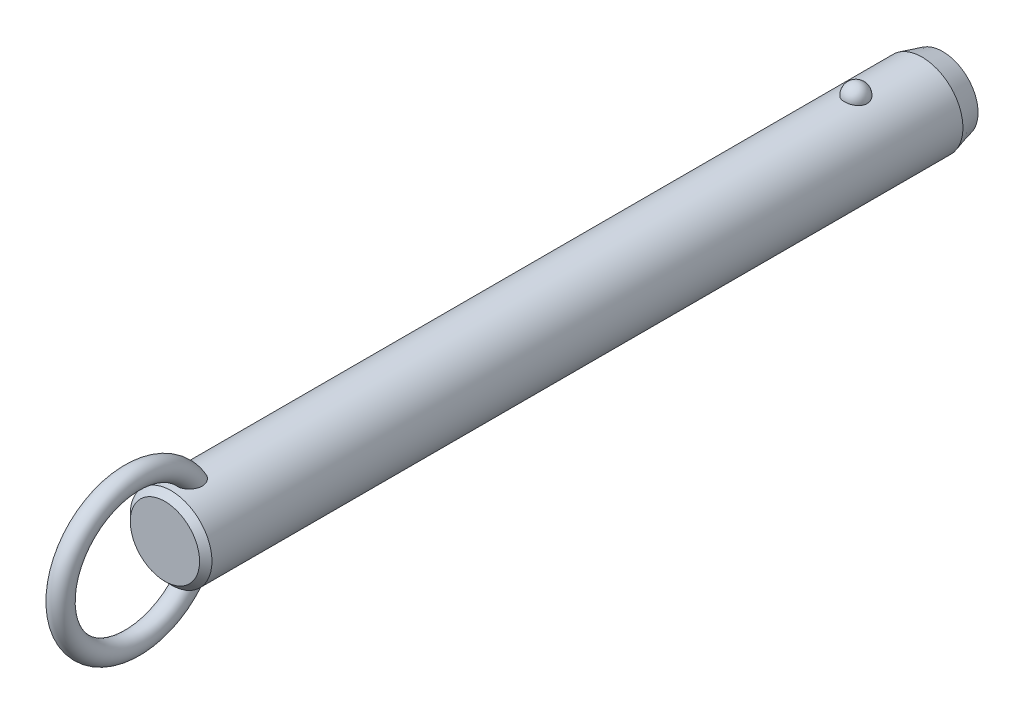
ISO-10303-21;
HEADER;
FILE_DESCRIPTION(('STEP AP214'),'2;1');
FILE_NAME('part.step','',(''),(''),'','','');
FILE_SCHEMA(('AUTOMOTIVE_DESIGN { 1 0 10303 214 1 1 1 1 }'));
ENDSEC;
DATA;
#1=APPLICATION_CONTEXT('core data for automotive mechanical design processes');
#2=APPLICATION_PROTOCOL_DEFINITION('international standard','automotive_design',2000,#1);
#3=PRODUCT_CONTEXT('',#1,'mechanical');
#4=PRODUCT('Part','Part','',(#3));
#5=PRODUCT_RELATED_PRODUCT_CATEGORY('part','',(#4));
#6=PRODUCT_DEFINITION_FORMATION('','',#4);
#7=PRODUCT_DEFINITION_CONTEXT('part definition',#1,'design');
#8=PRODUCT_DEFINITION('design','',#6,#7);
#9=PRODUCT_DEFINITION_SHAPE('','',#8);
#10=(LENGTH_UNIT() NAMED_UNIT(*) SI_UNIT(.MILLI.,.METRE.));
#11=(NAMED_UNIT(*) PLANE_ANGLE_UNIT() SI_UNIT($,.RADIAN.));
#12=(NAMED_UNIT(*) SI_UNIT($,.STERADIAN.) SOLID_ANGLE_UNIT());
#13=UNCERTAINTY_MEASURE_WITH_UNIT(LENGTH_MEASURE(1.E-05),#10,'distance_accuracy_value','');
#14=(GEOMETRIC_REPRESENTATION_CONTEXT(3) GLOBAL_UNCERTAINTY_ASSIGNED_CONTEXT((#13)) GLOBAL_UNIT_ASSIGNED_CONTEXT((#10,
#11,#12)) REPRESENTATION_CONTEXT('',''));
#15=CARTESIAN_POINT('',(0.,0.,0.));
#16=DIRECTION('',(0.,0.,1.));
#17=DIRECTION('',(1.,0.,0.));
#18=AXIS2_PLACEMENT_3D('',#15,#16,#17);
#19=CARTESIAN_POINT('',(0.,0.,121.9));
#20=DIRECTION('',(0.,0.,-1.));
#21=DIRECTION('',(-1.,0.,0.));
#22=AXIS2_PLACEMENT_3D('',#19,#20,#21);
#23=CYLINDRICAL_SURFACE('',#22,7.9);
#24=CARTESIAN_POINT('',(2.1785689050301,7.59367088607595,-2.19999999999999));
#25=CARTESIAN_POINT('',(2.17856679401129,7.59367269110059,-2.07701843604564));
#26=CARTESIAN_POINT('',(2.16853481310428,7.59657145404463,-1.95401006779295));
#27=CARTESIAN_POINT('',(2.12864689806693,7.607843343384,-1.71147811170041));
#28=CARTESIAN_POINT('',(2.09878338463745,7.61621856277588,-1.59195587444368));
#29=CARTESIAN_POINT('',(2.0199931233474,7.63749180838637,-1.3598563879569));
#30=CARTESIAN_POINT('',(1.97107475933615,7.6503878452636,-1.24727610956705));
#31=CARTESIAN_POINT('',(1.85539377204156,7.67926115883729,-1.03213234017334));
#32=CARTESIAN_POINT('',(1.78863158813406,7.69523835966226,-0.929568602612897));
#33=CARTESIAN_POINT('',(1.63856494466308,7.7285848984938,-0.736786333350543));
#34=CARTESIAN_POINT('',(1.55518140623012,7.7459606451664,-0.646630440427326));
#35=CARTESIAN_POINT('',(1.37422937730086,7.78009978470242,-0.481747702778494));
#36=CARTESIAN_POINT('',(1.27666086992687,7.79686317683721,-0.407020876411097));
#37=CARTESIAN_POINT('',(1.07024728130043,7.82786153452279,-0.275278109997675));
#38=CARTESIAN_POINT('',(0.961434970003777,7.84210353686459,-0.218212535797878));
#39=CARTESIAN_POINT('',(0.735351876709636,7.86652194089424,-0.123146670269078));
#40=CARTESIAN_POINT('',(0.618082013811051,7.87669878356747,-0.085144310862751));
#41=CARTESIAN_POINT('',(0.380637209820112,7.89170521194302,-0.0298158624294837));
#42=CARTESIAN_POINT('',(0.260550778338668,7.89662650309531,-0.0121347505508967));
#43=CARTESIAN_POINT('',(0.0190117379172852,7.90090003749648,0.00324379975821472));
#44=CARTESIAN_POINT('',(-0.102440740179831,7.90025280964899,0.00094313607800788));
#45=CARTESIAN_POINT('',(-0.341452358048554,7.89351056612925,-0.0233955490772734));
#46=CARTESIAN_POINT('',(-0.459042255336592,7.88749257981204,-0.0451545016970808));
#47=CARTESIAN_POINT('',(-0.688796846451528,7.87075812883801,-0.107408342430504));
#48=CARTESIAN_POINT('',(-0.800961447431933,7.86004158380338,-0.147903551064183));
#49=CARTESIAN_POINT('',(-1.01743634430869,7.83497131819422,-0.246799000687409));
#50=CARTESIAN_POINT('',(-1.12169791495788,7.82059709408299,-0.305300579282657));
#51=CARTESIAN_POINT('',(-1.31891765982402,7.78976470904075,-0.438549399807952));
#52=CARTESIAN_POINT('',(-1.41187469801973,7.77330633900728,-0.513298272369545));
#53=CARTESIAN_POINT('',(-1.58577142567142,7.73972434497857,-0.678622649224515));
#54=CARTESIAN_POINT('',(-1.66645140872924,7.72259402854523,-0.769470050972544));
#55=CARTESIAN_POINT('',(-1.81161503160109,7.68983776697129,-0.963538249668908));
#56=CARTESIAN_POINT('',(-1.87609753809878,7.6742119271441,-1.06675991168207));
#57=CARTESIAN_POINT('',(-1.98790138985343,7.6460202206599,-1.28401170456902));
#58=CARTESIAN_POINT('',(-2.03501994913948,7.63349104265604,-1.39815107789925));
#59=CARTESIAN_POINT('',(-2.10986724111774,7.6131449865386,-1.63301784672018));
#60=CARTESIAN_POINT('',(-2.1375965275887,7.60532797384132,-1.75374505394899));
#61=CARTESIAN_POINT('',(-2.17289256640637,7.5953195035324,-1.99782562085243));
#62=CARTESIAN_POINT('',(-2.18054294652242,7.59310471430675,-2.12116592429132));
#63=CARTESIAN_POINT('',(-2.17572919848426,7.59448538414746,-2.36741799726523));
#64=CARTESIAN_POINT('',(-2.1632656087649,7.59808068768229,-2.49032977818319));
#65=CARTESIAN_POINT('',(-2.11865035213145,7.61064035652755,-2.73161015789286));
#66=CARTESIAN_POINT('',(-2.08659579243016,7.61957823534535,-2.84999812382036));
#67=CARTESIAN_POINT('',(-2.00367799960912,7.64179982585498,-3.07955956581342));
#68=CARTESIAN_POINT('',(-1.9528140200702,7.65508371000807,-3.19073275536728));
#69=CARTESIAN_POINT('',(-1.83321113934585,7.68460381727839,-3.40337899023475));
#70=CARTESIAN_POINT('',(-1.76437735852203,7.70085556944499,-3.50479651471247));
#71=CARTESIAN_POINT('',(-1.61069526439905,7.73445734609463,-3.69446912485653));
#72=CARTESIAN_POINT('',(-1.52584634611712,7.75180741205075,-3.78272371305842));
#73=CARTESIAN_POINT('',(-1.34198059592,7.78574608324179,-3.94393987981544));
#74=CARTESIAN_POINT('',(-1.24291308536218,7.80233167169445,-4.01684434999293));
#75=CARTESIAN_POINT('',(-1.03352039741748,7.83281625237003,-4.14489386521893));
#76=CARTESIAN_POINT('',(-0.92319600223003,7.84671543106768,-4.20004014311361));
#77=CARTESIAN_POINT('',(-0.695822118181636,7.87011575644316,-4.29042017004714));
#78=CARTESIAN_POINT('',(-0.578872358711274,7.87966903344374,-4.32589112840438));
#79=CARTESIAN_POINT('',(-0.340410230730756,7.8935652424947,-4.37692226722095));
#80=CARTESIAN_POINT('',(-0.218898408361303,7.89790879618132,-4.39248482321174));
#81=CARTESIAN_POINT('',(0.0228107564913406,7.90087453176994,-4.40314405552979));
#82=CARTESIAN_POINT('',(0.142990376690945,7.89960185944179,-4.39861683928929));
#83=CARTESIAN_POINT('',(0.380829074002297,7.89171262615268,-4.37008293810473));
#84=CARTESIAN_POINT('',(0.498488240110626,7.8850962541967,-4.34607694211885));
#85=CARTESIAN_POINT('',(0.727535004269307,7.86726442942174,-4.27939317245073));
#86=CARTESIAN_POINT('',(0.838944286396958,7.85606616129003,-4.236785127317));
#87=CARTESIAN_POINT('',(1.05295421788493,7.83025654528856,-4.13408348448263));
#88=CARTESIAN_POINT('',(1.15555431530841,7.81564498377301,-4.07398879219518));
#89=CARTESIAN_POINT('',(1.35076763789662,7.7843022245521,-3.93687432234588));
#90=CARTESIAN_POINT('',(1.4432046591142,7.76754209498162,-3.85961036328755));
#91=CARTESIAN_POINT('',(1.6139111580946,7.73387857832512,-3.69076949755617));
#92=CARTESIAN_POINT('',(1.6921781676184,7.71697516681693,-3.59919010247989));
#93=CARTESIAN_POINT('',(1.83380875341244,7.6845643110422,-3.40247278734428));
#94=CARTESIAN_POINT('',(1.89689280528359,7.66908588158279,-3.29712873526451));
#95=CARTESIAN_POINT('',(2.0047823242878,7.64159441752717,-3.07707931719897));
#96=CARTESIAN_POINT('',(2.0495945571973,7.62958010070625,-2.96237743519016));
#97=CARTESIAN_POINT('',(2.11580183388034,7.61146617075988,-2.74040519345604));
#98=CARTESIAN_POINT('',(2.13929812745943,7.60484503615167,-2.63379846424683));
#99=CARTESIAN_POINT('',(2.17068242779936,7.59594664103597,-2.41813481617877));
#100=CARTESIAN_POINT('',(2.17857077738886,7.59366928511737,-2.30907795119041));
#101=CARTESIAN_POINT('',(2.1785689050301,7.59367088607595,-2.19999999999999));
#102=B_SPLINE_CURVE_WITH_KNOTS('',3,(#24,#25,#26,#27,#28,#29,#30,#31,#32,#33,#34,#35,#36,#37,
#38,#39,#40,#41,#42,#43,#44,#45,#46,#47,#48,#49,#50,#51,#52,#53,#54,#55,#56,#57,#58,#59,#60,#61,
#62,#63,#64,#65,#66,#67,#68,#69,#70,#71,#72,#73,#74,#75,#76,#77,#78,#79,#80,#81,#82,#83,#84,#85,
#86,#87,#88,#89,#90,#91,#92,#93,#94,#95,#96,#97,#98,#99,#100,#101),.UNSPECIFIED.,.T.,.F.,(4,2,2,
2,2,2,2,2,2,2,2,2,2,2,2,2,2,2,2,2,2,2,2,2,2,2,2,2,2,2,2,2,2,2,2,2,2,2,4),(0.,0.368552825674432,
0.737246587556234,1.10577831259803,1.4743009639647,1.8446206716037,2.21494081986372,
2.5842105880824,2.95344028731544,3.31611630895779,3.67875788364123,4.03628044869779,
4.39380913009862,4.75338791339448,5.11300280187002,5.47939989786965,5.8458226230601,
6.21639834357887,6.58696347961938,6.95598276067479,7.32499216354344,7.69218715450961,
8.0593967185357,8.42858578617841,8.79778880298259,9.16834203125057,9.5388695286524,
9.90482699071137,10.2707407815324,10.6298333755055,10.9889132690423,11.3466585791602,
11.7044262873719,12.0676511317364,12.4309391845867,12.8004764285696,13.1698767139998,
13.4967701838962,13.8236564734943),.UNSPECIFIED.);
#103=CARTESIAN_POINT('',(2.1785689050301,7.59367088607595,-2.19999999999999));
#104=VERTEX_POINT('',#103);
#105=EDGE_CURVE('E41',#104,#104,#102,.T.);
#106=ORIENTED_EDGE('',*,*,#105,.T.);
#107=EDGE_LOOP('',(#106));
#108=FACE_BOUND('',#107,.T.);
#109=CARTESIAN_POINT('',(0.,0.,130.22));
#110=DIRECTION('',(0.,0.,1.));
#111=DIRECTION('',(1.,0.,0.));
#112=AXIS2_PLACEMENT_3D('',#109,#110,#111);
#113=CIRCLE('',#112,7.9);
#114=CARTESIAN_POINT('',(7.9,0.,130.22));
#115=VERTEX_POINT('',#114);
#116=EDGE_CURVE('E10',#115,#115,#113,.F.);
#117=ORIENTED_EDGE('',*,*,#116,.T.);
#118=EDGE_LOOP('',(#117));
#119=FACE_BOUND('',#118,.T.);
#120=CARTESIAN_POINT('',(-0.630969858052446,-7.87476203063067,124.112432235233));
#121=CARTESIAN_POINT('',(-0.734180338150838,-7.8664899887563,124.147285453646));
#122=CARTESIAN_POINT('',(-0.834476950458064,-7.85639291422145,124.190816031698));
#123=CARTESIAN_POINT('',(-1.02620356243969,-7.83366343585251,124.294094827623));
#124=CARTESIAN_POINT('',(-1.1176141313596,-7.82102565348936,124.353877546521));
#125=CARTESIAN_POINT('',(-1.28877277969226,-7.79464922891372,124.487839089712));
#126=CARTESIAN_POINT('',(-1.36854014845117,-7.78091246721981,124.561993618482));
#127=CARTESIAN_POINT('',(-1.5146152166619,-7.75380398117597,124.722494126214));
#128=CARTESIAN_POINT('',(-1.58092966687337,-7.74043207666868,124.808833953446));
#129=CARTESIAN_POINT('',(-1.70019064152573,-7.71512522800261,124.992978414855));
#130=CARTESIAN_POINT('',(-1.75284037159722,-7.70322473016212,125.090979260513));
#131=CARTESIAN_POINT('',(-1.84263464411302,-7.68224112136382,125.294102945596));
#132=CARTESIAN_POINT('',(-1.87977299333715,-7.6731591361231,125.399228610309));
#133=CARTESIAN_POINT('',(-1.94152728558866,-7.65777930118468,125.623284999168));
#134=CARTESIAN_POINT('',(-1.96475471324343,-7.65179654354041,125.742616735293));
#135=CARTESIAN_POINT('',(-1.99449499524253,-7.64409642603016,125.98342986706));
#136=CARTESIAN_POINT('',(-2.0010005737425,-7.64238092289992,126.104912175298));
#137=CARTESIAN_POINT('',(-1.99856014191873,-7.64302120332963,126.368340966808));
#138=CARTESIAN_POINT('',(-1.98680021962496,-7.64611845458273,126.51025654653));
#139=CARTESIAN_POINT('',(-1.94457772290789,-7.65696186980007,126.791118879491));
#140=CARTESIAN_POINT('',(-1.91409393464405,-7.66471330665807,126.930062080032));
#141=CARTESIAN_POINT('',(-1.82768670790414,-7.68582947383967,127.231939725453));
#142=CARTESIAN_POINT('',(-1.76772963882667,-7.70003779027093,127.393686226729));
#143=CARTESIAN_POINT('',(-1.65998501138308,-7.72371550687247,127.627695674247));
#144=CARTESIAN_POINT('',(-1.62107967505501,-7.73200670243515,127.704297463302));
#145=CARTESIAN_POINT('',(-1.53727726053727,-7.74910377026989,127.854079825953));
#146=CARTESIAN_POINT('',(-1.49238215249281,-7.75790947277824,127.927261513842));
#147=CARTESIAN_POINT('',(-1.37397050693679,-7.77993338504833,128.10288382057));
#148=CARTESIAN_POINT('',(-1.29690364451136,-7.79328473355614,128.202955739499));
#149=CARTESIAN_POINT('',(-1.1288548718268,-7.81939266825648,128.390714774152));
#150=CARTESIAN_POINT('',(-1.0378992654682,-7.83215032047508,128.478424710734));
#151=CARTESIAN_POINT('',(-0.869532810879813,-7.85231710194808,128.613414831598));
#152=CARTESIAN_POINT('',(-0.795716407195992,-7.86021093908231,128.665076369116));
#153=CARTESIAN_POINT('',(-0.640813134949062,-7.87434920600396,128.756381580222));
#154=CARTESIAN_POINT('',(-0.559737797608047,-7.88059619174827,128.79604389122));
#155=CARTESIAN_POINT('',(-0.406456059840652,-7.88984116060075,128.854300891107));
#156=CARTESIAN_POINT('',(-0.335227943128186,-7.89321892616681,128.875384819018));
#157=CARTESIAN_POINT('',(-0.190193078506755,-7.89804235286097,128.90541418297));
#158=CARTESIAN_POINT('',(-0.116388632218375,-7.89948969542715,128.914370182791));
#159=CARTESIAN_POINT('',(0.0318414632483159,-7.90028409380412,128.919291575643));
#160=CARTESIAN_POINT('',(0.106268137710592,-7.89962640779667,128.915227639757));
#161=CARTESIAN_POINT('',(0.253290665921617,-7.8962818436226,128.894461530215));
#162=CARTESIAN_POINT('',(0.325885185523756,-7.8935935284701,128.877750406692));
#163=CARTESIAN_POINT('',(0.481441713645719,-7.88577340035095,128.828738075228));
#164=CARTESIAN_POINT('',(0.563611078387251,-7.88026321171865,128.794005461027));
#165=CARTESIAN_POINT('',(0.721129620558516,-7.86741729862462,128.711796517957));
#166=CARTESIAN_POINT('',(0.79646633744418,-7.86007832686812,128.664297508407));
#167=CARTESIAN_POINT('',(0.971456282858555,-7.84073285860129,128.536513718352));
#168=CARTESIAN_POINT('',(1.06719686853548,-7.82809461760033,128.451004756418));
#169=CARTESIAN_POINT('',(1.24418921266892,-7.80192439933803,128.266232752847));
#170=CARTESIAN_POINT('',(1.32540832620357,-7.78839049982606,128.166939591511));
#171=CARTESIAN_POINT('',(1.45199971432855,-7.76559693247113,127.989576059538));
#172=CARTESIAN_POINT('',(1.50085649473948,-7.75626094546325,127.913954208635));
#173=CARTESIAN_POINT('',(1.59197749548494,-7.73807279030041,127.758742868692));
#174=CARTESIAN_POINT('',(1.63423919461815,-7.72922080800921,127.679151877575));
#175=CARTESIAN_POINT('',(1.71222612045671,-7.71231959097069,127.516664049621));
#176=CARTESIAN_POINT('',(1.74794516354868,-7.70427111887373,127.433764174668));
#177=CARTESIAN_POINT('',(1.81270113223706,-7.68929240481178,127.265296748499));
#178=CARTESIAN_POINT('',(1.84173789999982,-7.68236218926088,127.179729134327));
#179=CARTESIAN_POINT('',(1.89322698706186,-7.6698375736,127.00528702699));
#180=CARTESIAN_POINT('',(1.91558744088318,-7.66426199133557,126.916383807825));
#181=CARTESIAN_POINT('',(1.95281367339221,-7.65485915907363,126.736969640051));
#182=CARTESIAN_POINT('',(1.96767946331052,-7.65103190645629,126.646458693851));
#183=CARTESIAN_POINT('',(2.0002145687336,-7.64262981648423,126.373732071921));
#184=CARTESIAN_POINT('',(2.00600691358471,-7.6410871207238,126.189709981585));
#185=CARTESIAN_POINT('',(1.98445334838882,-7.64669564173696,125.876501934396));
#186=CARTESIAN_POINT('',(1.96607186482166,-7.65149688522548,125.746618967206));
#187=CARTESIAN_POINT('',(1.90884967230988,-7.66597624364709,125.491632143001));
#188=CARTESIAN_POINT('',(1.87002101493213,-7.67565148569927,125.366525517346));
#189=CARTESIAN_POINT('',(1.77063986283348,-7.69918471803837,125.12454013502));
#190=CARTESIAN_POINT('',(1.70993724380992,-7.71307150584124,125.007725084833));
#191=CARTESIAN_POINT('',(1.56733070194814,-7.74330306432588,124.788144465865));
#192=CARTESIAN_POINT('',(1.48543692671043,-7.75964665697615,124.685372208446));
#193=CARTESIAN_POINT('',(1.31346177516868,-7.79047523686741,124.509380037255));
#194=CARTESIAN_POINT('',(1.22547278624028,-7.80495298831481,124.434106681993));
#195=CARTESIAN_POINT('',(1.03724352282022,-7.83218597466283,124.300486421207));
#196=CARTESIAN_POINT('',(0.937008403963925,-7.84494192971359,124.242132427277));
#197=CARTESIAN_POINT('',(0.733599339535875,-7.86649045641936,124.147027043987));
#198=CARTESIAN_POINT('',(0.630941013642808,-7.87547134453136,124.109210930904));
#199=CARTESIAN_POINT('',(0.420465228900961,-7.88950708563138,124.051116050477));
#200=CARTESIAN_POINT('',(0.312645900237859,-7.89456050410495,124.03084369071));
#201=CARTESIAN_POINT('',(0.0960869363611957,-7.9001518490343,124.008455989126));
#202=CARTESIAN_POINT('',(-0.0126341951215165,-7.90073226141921,124.006169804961));
#203=CARTESIAN_POINT('',(-0.228766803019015,-7.89742350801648,124.019367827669));
#204=CARTESIAN_POINT('',(-0.336180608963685,-7.89354403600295,124.034813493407));
#205=CARTESIAN_POINT('',(-0.473410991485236,-7.88586871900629,124.066217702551));
#206=CARTESIAN_POINT('',(-0.505257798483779,-7.88388984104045,124.074354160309));
#207=CARTESIAN_POINT('',(-0.568481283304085,-7.87958326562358,124.092208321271));
#208=CARTESIAN_POINT('',(-0.599857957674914,-7.87725556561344,124.101926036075));
#209=CARTESIAN_POINT('',(-0.630969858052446,-7.87476203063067,124.112432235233));
#210=B_SPLINE_CURVE_WITH_KNOTS('',3,(#120,#121,#122,#123,#124,#125,#126,#127,#128,#129,#130,
#131,#132,#133,#134,#135,#136,#137,#138,#139,#140,#141,#142,#143,#144,#145,#146,#147,#148,#149,
#150,#151,#152,#153,#154,#155,#156,#157,#158,#159,#160,#161,#162,#163,#164,#165,#166,#167,#168,
#169,#170,#171,#172,#173,#174,#175,#176,#177,#178,#179,#180,#181,#182,#183,#184,#185,#186,#187,
#188,#189,#190,#191,#192,#193,#194,#195,#196,#197,#198,#199,#200,#201,#202,#203,#204,#205,#206,
#207,#208,#209),.UNSPECIFIED.,.T.,.F.,(4,2,2,2,2,2,2,2,2,2,2,2,2,2,2,2,2,2,2,2,2,2,2,2,2,2,2,2,
2,2,2,2,2,2,2,2,2,2,2,2,2,2,2,2,4),(0.,0.327622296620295,0.655945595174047,0.983718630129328,
1.3113267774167,1.64554655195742,1.97989964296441,2.34365728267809,2.70757317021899,
3.13333684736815,3.55958380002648,4.07655306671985,4.33527897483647,4.593919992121,
4.9738243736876,5.35301797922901,5.62348245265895,5.89352465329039,6.11565959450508,
6.33760092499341,6.56004255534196,6.78264174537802,7.04930844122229,7.31645206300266,
7.70130871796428,8.08701995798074,8.35824509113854,8.6295736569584,8.90115735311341,
9.1727474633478,9.447918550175,9.7230892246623,10.2715298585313,10.6638393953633,
11.0559179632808,11.4507403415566,11.8453740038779,12.1936425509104,12.5417649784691,
12.8695063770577,13.1973674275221,13.5221104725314,13.8461490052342,13.9449071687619,
14.0436660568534),.UNSPECIFIED.);
#211=CARTESIAN_POINT('',(-0.630969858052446,-7.87476203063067,124.112432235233));
#212=VERTEX_POINT('',#211);
#213=EDGE_CURVE('E59',#212,#212,#210,.T.);
#214=ORIENTED_EDGE('',*,*,#213,.T.);
#215=EDGE_LOOP('',(#214));
#216=FACE_BOUND('',#215,.T.);
#217=CARTESIAN_POINT('',(-0.630969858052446,7.87476203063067,124.112432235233));
#218=CARTESIAN_POINT('',(-0.528918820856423,7.88293636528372,124.077979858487));
#219=CARTESIAN_POINT('',(-0.42374551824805,7.8893481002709,124.051915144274));
#220=CARTESIAN_POINT('',(-0.210236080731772,7.8979273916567,124.017282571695));
#221=CARTESIAN_POINT('',(-0.10189380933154,7.90008607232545,124.008751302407));
#222=CARTESIAN_POINT('',(0.114660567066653,7.89990877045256,124.009457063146));
#223=CARTESIAN_POINT('',(0.222872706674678,7.89757640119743,124.01867980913));
#224=CARTESIAN_POINT('',(0.436107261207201,7.88867538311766,124.054652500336));
#225=CARTESIAN_POINT('',(0.541131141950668,7.8821087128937,124.08139425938));
#226=CARTESIAN_POINT('',(0.745085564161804,7.86545130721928,124.151756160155));
#227=CARTESIAN_POINT('',(0.844015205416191,7.85536005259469,124.195378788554));
#228=CARTESIAN_POINT('',(1.03299167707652,7.83275153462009,124.298379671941));
#229=CARTESIAN_POINT('',(1.12303841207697,7.8202342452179,124.357758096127));
#230=CARTESIAN_POINT('',(1.29214734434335,7.79408219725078,124.490864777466));
#231=CARTESIAN_POINT('',(1.37116907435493,7.78044359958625,124.564643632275));
#232=CARTESIAN_POINT('',(1.51597677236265,7.75353170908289,124.724235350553));
#233=CARTESIAN_POINT('',(1.58176261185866,7.74025841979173,124.810048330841));
#234=CARTESIAN_POINT('',(1.70057386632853,7.71504069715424,124.993644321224));
#235=CARTESIAN_POINT('',(1.75320073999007,7.70314257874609,125.091690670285));
#236=CARTESIAN_POINT('',(1.84293767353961,7.68216822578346,125.294893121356));
#237=CARTESIAN_POINT('',(1.88004278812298,7.67309289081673,125.400051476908));
#238=CARTESIAN_POINT('',(1.9417232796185,7.6577294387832,125.624167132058));
#239=CARTESIAN_POINT('',(1.96491037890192,7.65175648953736,125.743524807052));
#240=CARTESIAN_POINT('',(1.9945689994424,7.64407702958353,125.984384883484));
#241=CARTESIAN_POINT('',(2.00103304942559,7.64237242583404,126.10588821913));
#242=CARTESIAN_POINT('',(1.9985016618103,7.64303650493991,126.369368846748));
#243=CARTESIAN_POINT('',(1.98669038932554,7.64614714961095,126.511314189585));
#244=CARTESIAN_POINT('',(1.94436120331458,7.6570170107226,126.792228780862));
#245=CARTESIAN_POINT('',(1.9138220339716,7.66478150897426,126.931194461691));
#246=CARTESIAN_POINT('',(1.82728754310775,7.68592483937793,127.233111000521));
#247=CARTESIAN_POINT('',(1.76725778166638,7.70014685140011,127.394872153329));
#248=CARTESIAN_POINT('',(1.65939700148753,7.72384204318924,127.628891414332));
#249=CARTESIAN_POINT('',(1.62045187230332,7.73213852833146,127.705494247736));
#250=CARTESIAN_POINT('',(1.53656684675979,7.74924489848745,127.855273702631));
#251=CARTESIAN_POINT('',(1.4916289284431,7.75805461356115,127.928451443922));
#252=CARTESIAN_POINT('',(1.37317698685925,7.78007342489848,128.103952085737));
#253=CARTESIAN_POINT('',(1.29612360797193,7.79341423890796,128.203911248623));
#254=CARTESIAN_POINT('',(1.12812043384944,7.81949839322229,128.39145083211));
#255=CARTESIAN_POINT('',(1.03719688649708,7.83224280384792,128.479054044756));
#256=CARTESIAN_POINT('',(0.868871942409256,7.85239026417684,128.61389715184));
#257=CARTESIAN_POINT('',(0.795056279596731,7.86027769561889,128.665511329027));
#258=CARTESIAN_POINT('',(0.640160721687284,7.87440222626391,128.756720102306));
#259=CARTESIAN_POINT('',(0.559092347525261,7.88064188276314,128.796333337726));
#260=CARTESIAN_POINT('',(0.405820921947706,7.8898738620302,128.854505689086));
#261=CARTESIAN_POINT('',(0.334594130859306,7.89324577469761,128.875552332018));
#262=CARTESIAN_POINT('',(0.189568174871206,7.89805733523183,128.905507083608));
#263=CARTESIAN_POINT('',(0.115771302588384,7.89949866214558,128.914425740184));
#264=CARTESIAN_POINT('',(-0.032435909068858,7.90028156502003,128.91927589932));
#265=CARTESIAN_POINT('',(-0.106847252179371,7.89961843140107,128.915178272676));
#266=CARTESIAN_POINT('',(-0.253834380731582,7.8962642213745,128.894351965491));
#267=CARTESIAN_POINT('',(-0.326408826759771,7.89357170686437,128.877614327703));
#268=CARTESIAN_POINT('',(-0.481962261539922,7.88574179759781,128.828539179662));
#269=CARTESIAN_POINT('',(-0.564145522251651,7.88022507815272,128.793763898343));
#270=CARTESIAN_POINT('',(-0.721685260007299,7.86736646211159,128.711468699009));
#271=CARTESIAN_POINT('',(-0.797029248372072,7.8600213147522,128.663926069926));
#272=CARTESIAN_POINT('',(-0.972044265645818,7.84066026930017,128.536026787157));
#273=CARTESIAN_POINT('',(-1.0677980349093,7.828012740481,128.450443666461));
#274=CARTESIAN_POINT('',(-1.24480531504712,7.80182621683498,128.265522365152));
#275=CARTESIAN_POINT('',(-1.32602618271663,7.78828530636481,128.166154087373));
#276=CARTESIAN_POINT('',(-1.4525983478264,7.76548487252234,127.988680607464));
#277=CARTESIAN_POINT('',(-1.50143856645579,7.75614818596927,127.913025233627));
#278=CARTESIAN_POINT('',(-1.59252410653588,7.73796020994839,127.757748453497));
#279=CARTESIAN_POINT('',(-1.63476690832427,7.729109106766,127.678125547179));
#280=CARTESIAN_POINT('',(-1.71271318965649,7.71221133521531,127.515575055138));
#281=CARTESIAN_POINT('',(-1.74841047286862,7.70416543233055,127.432644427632));
#282=CARTESIAN_POINT('',(-1.81311929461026,7.6891937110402,127.264116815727));
#283=CARTESIAN_POINT('',(-1.84213067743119,7.68226791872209,127.178519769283));
#284=CARTESIAN_POINT('',(-1.89356259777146,7.66975461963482,127.004025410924));
#285=CARTESIAN_POINT('',(-1.91589165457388,7.66418586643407,126.915099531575));
#286=CARTESIAN_POINT('',(-1.95305070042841,7.65479859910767,126.735642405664));
#287=CARTESIAN_POINT('',(-1.96788069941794,7.65098008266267,126.645111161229));
#288=CARTESIAN_POINT('',(-2.00030078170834,7.64260704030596,126.372327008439));
#289=CARTESIAN_POINT('',(-2.00600576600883,7.64108760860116,126.188271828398));
#290=CARTESIAN_POINT('',(-1.9842848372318,7.64673945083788,125.875080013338));
#291=CARTESIAN_POINT('',(-1.96583698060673,7.65155751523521,125.745240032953));
#292=CARTESIAN_POINT('',(-1.90848948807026,7.66606613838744,125.490361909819));
#293=CARTESIAN_POINT('',(-1.86960376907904,7.67575338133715,125.365320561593));
#294=CARTESIAN_POINT('',(-1.77013421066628,7.6993013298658,125.123500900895));
#295=CARTESIAN_POINT('',(-1.70940488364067,7.71318991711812,125.006784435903));
#296=CARTESIAN_POINT('',(-1.56672953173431,7.74342495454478,124.787340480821));
#297=CARTESIAN_POINT('',(-1.48478316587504,7.75977144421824,124.68461321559));
#298=CARTESIAN_POINT('',(-1.31266325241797,7.79061163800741,124.508643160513));
#299=CARTESIAN_POINT('',(-1.22456383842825,7.80509908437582,124.433358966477));
#300=CARTESIAN_POINT('',(-1.03622400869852,7.83231881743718,124.299865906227));
#301=CARTESIAN_POINT('',(-0.93601531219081,7.84505551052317,124.241613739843));
#302=CARTESIAN_POINT('',(-0.798824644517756,7.85957802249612,124.177540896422));
#303=CARTESIAN_POINT('',(-0.765787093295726,7.86286821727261,124.163224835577));
#304=CARTESIAN_POINT('',(-0.698939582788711,7.86909211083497,124.136436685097));
#305=CARTESIAN_POINT('',(-0.665129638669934,7.8720258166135,124.123964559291));
#306=CARTESIAN_POINT('',(-0.630969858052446,7.87476203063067,124.112432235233));
#307=B_SPLINE_CURVE_WITH_KNOTS('',3,(#217,#218,#219,#220,#221,#222,#223,#224,#225,#226,#227,
#228,#229,#230,#231,#232,#233,#234,#235,#236,#237,#238,#239,#240,#241,#242,#243,#244,#245,#246,
#247,#248,#249,#250,#251,#252,#253,#254,#255,#256,#257,#258,#259,#260,#261,#262,#263,#264,#265,
#266,#267,#268,#269,#270,#271,#272,#273,#274,#275,#276,#277,#278,#279,#280,#281,#282,#283,#284,
#285,#286,#287,#288,#289,#290,#291,#292,#293,#294,#295,#296,#297,#298,#299,#300,#301,#302,#303,
#304,#305,#306),.UNSPECIFIED.,.T.,.F.,(4,2,2,2,2,2,2,2,2,2,2,2,2,2,2,2,2,2,2,2,2,2,2,2,2,2,2,2,
2,2,2,2,2,2,2,2,2,2,2,2,2,2,2,2,4),(0.,0.323920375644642,0.648516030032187,0.97285063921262,
1.29703380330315,1.62126473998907,1.94549915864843,2.27089401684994,2.5962920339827,
2.93059633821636,3.26500707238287,3.62881644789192,3.99278833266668,4.41865421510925,
4.84500434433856,5.36209210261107,5.62087589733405,5.87957448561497,6.25918598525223,
6.63808782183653,6.90846748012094,7.17842501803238,7.40052350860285,7.62242871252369,
7.84483086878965,8.0673907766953,8.3341461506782,8.60137921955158,8.98641454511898,
9.37230415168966,9.64358673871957,9.91497268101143,10.1866142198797,10.4582620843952,
10.7334745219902,11.0086865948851,11.5572126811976,11.9494246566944,12.3413699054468,
12.7359755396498,13.1305875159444,13.4791770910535,13.82687259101,13.9353013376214,
14.0437279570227),.UNSPECIFIED.);
#308=CARTESIAN_POINT('',(-0.630969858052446,7.87476203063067,124.112432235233));
#309=VERTEX_POINT('',#308);
#310=EDGE_CURVE('E67',#309,#309,#307,.T.);
#311=ORIENTED_EDGE('',*,*,#310,.T.);
#312=EDGE_LOOP('',(#311));
#313=FACE_BOUND('',#312,.T.);
#314=CARTESIAN_POINT('',(0.,0.,-14.9999999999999));
#315=DIRECTION('',(0.,0.,-1.));
#316=DIRECTION('',(-1.,0.,0.));
#317=AXIS2_PLACEMENT_3D('',#314,#315,#316);
#318=CIRCLE('',#317,7.9);
#319=CARTESIAN_POINT('',(-7.9,0.,-14.9999999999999));
#320=VERTEX_POINT('',#319);
#321=EDGE_CURVE('E56',#320,#320,#318,.F.);
#322=ORIENTED_EDGE('',*,*,#321,.T.);
#323=EDGE_LOOP('',(#322));
#324=FACE_BOUND('',#323,.T.);
#325=ADVANCED_FACE('F37',(#108,#119,#216,#313,#324),#23,.T.);
#326=CARTESIAN_POINT('',(0.,0.,-19.));
#327=DIRECTION('',(0.,0.,-1.));
#328=DIRECTION('',(-1.,0.,0.));
#329=AXIS2_PLACEMENT_3D('',#326,#327,#328);
#330=PLANE('',#329);
#331=CARTESIAN_POINT('',(0.,0.,-19.));
#332=DIRECTION('',(0.,0.,-1.));
#333=DIRECTION('',(-1.,0.,0.));
#334=AXIS2_PLACEMENT_3D('',#331,#332,#333);
#335=CIRCLE('',#334,6.82820323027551);
#336=CARTESIAN_POINT('',(-6.82820323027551,0.,-19.));
#337=VERTEX_POINT('',#336);
#338=EDGE_CURVE('E66',#337,#337,#335,.T.);
#339=ORIENTED_EDGE('',*,*,#338,.T.);
#340=EDGE_LOOP('',(#339));
#341=FACE_BOUND('',#340,.T.);
#342=ADVANCED_FACE('F85',(#341),#330,.T.);
#343=CARTESIAN_POINT('',(0.,0.,-19.));
#344=DIRECTION('',(0.,0.,1.));
#345=DIRECTION('',(1.,0.,0.));
#346=AXIS2_PLACEMENT_3D('',#343,#344,#345);
#347=CONICAL_SURFACE('',#346,6.82820323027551,0.261799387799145);
#348=ORIENTED_EDGE('',*,*,#321,.F.);
#349=EDGE_LOOP('',(#348));
#350=FACE_BOUND('',#349,.T.);
#351=ORIENTED_EDGE('',*,*,#338,.F.);
#352=EDGE_LOOP('',(#351));
#353=FACE_BOUND('',#352,.T.);
#354=ADVANCED_FACE('F83',(#350,#353),#347,.T.);
#355=CARTESIAN_POINT('',(0.,0.,131.42));
#356=DIRECTION('',(0.,0.,1.));
#357=DIRECTION('',(1.,0.,0.));
#358=AXIS2_PLACEMENT_3D('',#355,#356,#357);
#359=PLANE('',#358);
#360=CARTESIAN_POINT('',(0.,0.,131.42));
#361=DIRECTION('',(0.,0.,1.));
#362=DIRECTION('',(1.,0.,0.));
#363=AXIS2_PLACEMENT_3D('',#360,#361,#362);
#364=CIRCLE('',#363,6.69999999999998);
#365=CARTESIAN_POINT('',(6.69999999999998,0.,131.42));
#366=VERTEX_POINT('',#365);
#367=EDGE_CURVE('E50',#366,#366,#364,.T.);
#368=ORIENTED_EDGE('',*,*,#367,.T.);
#369=EDGE_LOOP('',(#368));
#370=FACE_BOUND('',#369,.T.);
#371=ADVANCED_FACE('F77',(#370),#359,.T.);
#372=CARTESIAN_POINT('',(0.,0.,137.75));
#373=DIRECTION('',(1.,0.,0.));
#374=DIRECTION('',(0.,0.,-1.));
#375=AXIS2_PLACEMENT_3D('',#372,#373,#374);
#376=TOROIDAL_SURFACE('',#375,13.85,2.);
#377=ORIENTED_EDGE('',*,*,#310,.F.);
#378=EDGE_LOOP('',(#377));
#379=FACE_BOUND('',#378,.T.);
#380=ORIENTED_EDGE('',*,*,#213,.F.);
#381=EDGE_LOOP('',(#380));
#382=FACE_BOUND('',#381,.T.);
#383=ADVANCED_FACE('F73',(#379,#382),#376,.T.);
#384=CARTESIAN_POINT('',(0.,0.,131.42));
#385=DIRECTION('',(0.,0.,-1.));
#386=DIRECTION('',(-1.,0.,0.));
#387=AXIS2_PLACEMENT_3D('',#384,#385,#386);
#388=CONICAL_SURFACE('',#387,6.69999999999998,0.785398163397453);
#389=ORIENTED_EDGE('',*,*,#116,.F.);
#390=EDGE_LOOP('',(#389));
#391=FACE_BOUND('',#390,.T.);
#392=ORIENTED_EDGE('',*,*,#367,.F.);
#393=EDGE_LOOP('',(#392));
#394=FACE_BOUND('',#393,.T.);
#395=ADVANCED_FACE('F39',(#391,#394),#388,.T.);
#396=CARTESIAN_POINT('',(0.,7.9,-2.19999999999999));
#397=DIRECTION('',(0.,1.,0.));
#398=DIRECTION('',(0.,0.,-1.));
#399=AXIS2_PLACEMENT_3D('',#396,#397,#398);
#400=SPHERICAL_SURFACE('',#399,2.2);
#401=ORIENTED_EDGE('',*,*,#105,.F.);
#402=EDGE_LOOP('',(#401));
#403=FACE_BOUND('',#402,.T.);
#404=ADVANCED_FACE('F79',(#403),#400,.T.);
#405=CLOSED_SHELL('',(#325,#342,#354,#371,#383,#395,#404));
#406=MANIFOLD_SOLID_BREP('B2',#405);
#407=ADVANCED_BREP_SHAPE_REPRESENTATION('',(#18,#406),#14);
#408=SHAPE_DEFINITION_REPRESENTATION(#9,#407);
ENDSEC;
END-ISO-10303-21;
